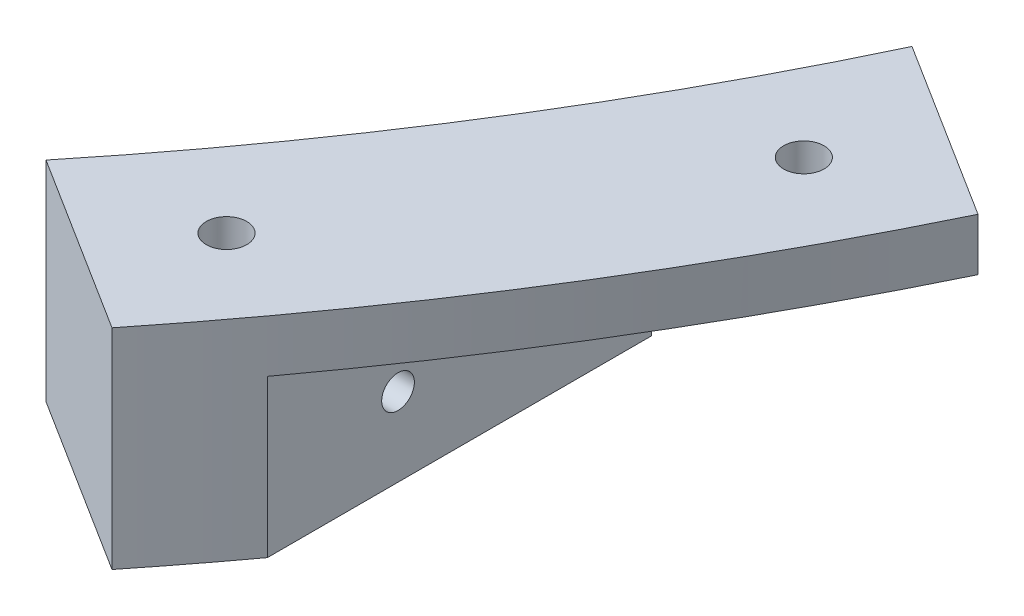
from build123d import *

# Parameters (mm, degrees)
BOSS_EXTRUDE1_DEPTH     = 50.8
CUT_EXTRUDE1_DEPTH      = 38.1
F_3_8_CLEARANCE_HOLE1_D = 9.8044
F_3_8_CLEARANCE_HOLE2_D = 9.8044
F_3_8_16_TAPPED_HOLE1_D = 7.9375
F_3_8_16_TAPPED_HOLE2_D = 7.9375


with BuildPart() as part:
    # Sketch1 → Boss-Extrude1 (new body)
    with BuildSketch(Plane.XZ.offset(80.9625)):
        with BuildLine():
            Line((574.034978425, 271.493726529), (617.309061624, 298.749330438))
            ThreePointArc((617.309061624, 298.749330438), (580.292307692, 365.489367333), (536.089202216, 427.703176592))
            Line((536.089202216, 427.703176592), (492.815119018, 400.447572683))
            ThreePointArc((492.815119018, 400.447572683), (537.307692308, 338.416080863), (574.034978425, 271.493726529))
        make_face()
    extrude(amount=-BOSS_EXTRUDE1_DEPTH)

    # Sketch2 → Cut-Extrude1 (cut)
    with BuildSketch(Plane.XZ.offset(80.9625)):
        with BuildLine():
            Line((552.45, 406.350387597), (552.45, 313.087843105))
            ThreePointArc((552.45, 313.087843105), (563.626311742, 292.489966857), (574.034978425, 271.493726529))
            Line((574.034978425, 271.493726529), (617.309061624, 298.749330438))
            ThreePointArc((617.309061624, 298.749330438), (587.348757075, 354.038243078), (552.45, 406.350387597))
        make_face()
    extrude(amount=-CUT_EXTRUDE1_DEPTH, mode=Mode.SUBTRACT)

    # 3_8 Clearance Hole1 (through all)
    with Locations(Plane(origin=(0, -80.9625, 0), x_dir=(-1, 0, 0), z_dir=(0, -1, 0))):
        with Locations((-530.071006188, -393.894514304)):
            Hole(F_3_8_CLEARANCE_HOLE1_D / 2)

    # 3_8 Clearance Hole2 (through all)
    with Locations(Plane(origin=(0, -30.1625, 0), x_dir=(1, 0, 0), z_dir=(0, 1, 0))):
        with Locations((584.217579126, -307.925283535)):
            Hole(F_3_8_CLEARANCE_HOLE2_D / 2)

    # 3_8-16 Tapped Hole1 (through all)
    with Locations(Plane(origin=(552.45, 0, 0), x_dir=(0, 0, -1), z_dir=(1, 0, 0))):
        with Locations((-374.65, -61.9125)):
            Hole(F_3_8_16_TAPPED_HOLE1_D / 2)

    # 3_8-16 Tapped Hole2 (through all)
    with Locations(Plane(origin=(552.45, 0, 0), x_dir=(0, 0, -1), z_dir=(1, 0, 0))):
        with Locations((-349.25, -61.9125)):
            Hole(F_3_8_16_TAPPED_HOLE2_D / 2)


solid = part.part
